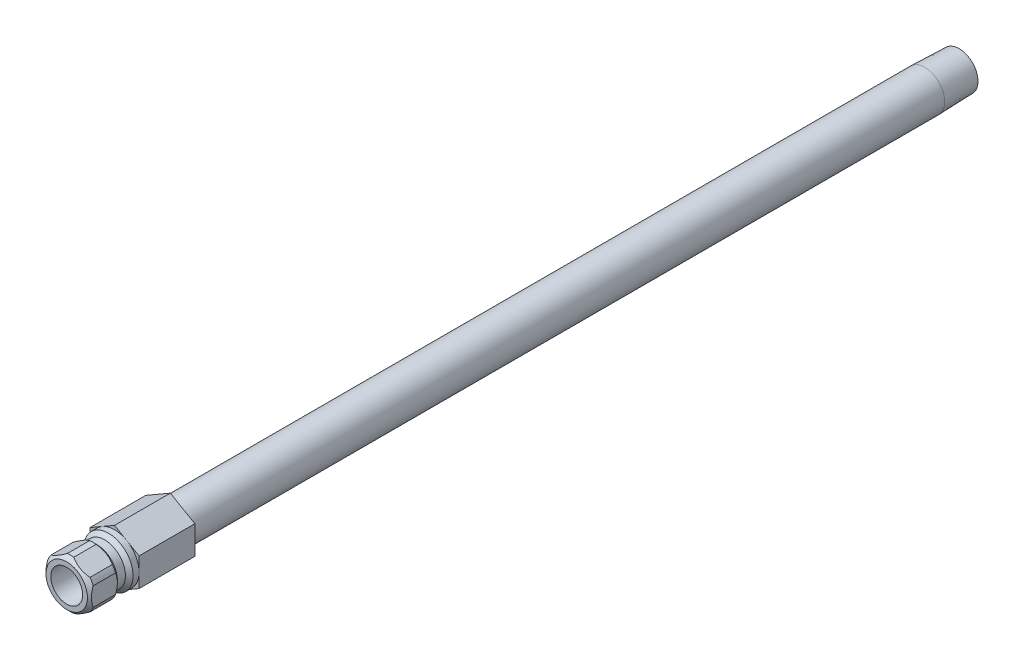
ISO-10303-21;
HEADER;
FILE_DESCRIPTION(('STEP AP214'),'2;1');
FILE_NAME('part.step','',(''),(''),'','','');
FILE_SCHEMA(('AUTOMOTIVE_DESIGN { 1 0 10303 214 1 1 1 1 }'));
ENDSEC;
DATA;
#1=APPLICATION_CONTEXT('core data for automotive mechanical design processes');
#2=APPLICATION_PROTOCOL_DEFINITION('international standard','automotive_design',2000,#1);
#3=PRODUCT_CONTEXT('',#1,'mechanical');
#4=PRODUCT('Part','Part','',(#3));
#5=PRODUCT_RELATED_PRODUCT_CATEGORY('part','',(#4));
#6=PRODUCT_DEFINITION_FORMATION('','',#4);
#7=PRODUCT_DEFINITION_CONTEXT('part definition',#1,'design');
#8=PRODUCT_DEFINITION('design','',#6,#7);
#9=PRODUCT_DEFINITION_SHAPE('','',#8);
#10=(LENGTH_UNIT() NAMED_UNIT(*) SI_UNIT(.MILLI.,.METRE.));
#11=(NAMED_UNIT(*) PLANE_ANGLE_UNIT() SI_UNIT($,.RADIAN.));
#12=(NAMED_UNIT(*) SI_UNIT($,.STERADIAN.) SOLID_ANGLE_UNIT());
#13=UNCERTAINTY_MEASURE_WITH_UNIT(LENGTH_MEASURE(1.E-05),#10,'distance_accuracy_value','');
#14=(GEOMETRIC_REPRESENTATION_CONTEXT(3) GLOBAL_UNCERTAINTY_ASSIGNED_CONTEXT((#13)) GLOBAL_UNIT_ASSIGNED_CONTEXT((#10,
#11,#12)) REPRESENTATION_CONTEXT('',''));
#15=CARTESIAN_POINT('',(0.,0.,0.));
#16=DIRECTION('',(0.,0.,1.));
#17=DIRECTION('',(1.,0.,0.));
#18=AXIS2_PLACEMENT_3D('',#15,#16,#17);
#19=CARTESIAN_POINT('',(0.,0.,0.));
#20=DIRECTION('',(0.,0.,-1.));
#21=DIRECTION('',(0.,1.,0.));
#22=AXIS2_PLACEMENT_3D('',#19,#20,#21);
#23=CYLINDRICAL_SURFACE('',#22,4.8895);
#24=DIRECTION('',(0.,0.,-1.));
#25=VECTOR('',#24,1.);
#26=CARTESIAN_POINT('',(-4.5212,-1.86170910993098,0.));
#27=LINE('',#26,#25);
#28=CARTESIAN_POINT('',(-4.5212,-1.86170910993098,4.318));
#29=VERTEX_POINT('',#28);
#30=CARTESIAN_POINT('',(-4.5212,-1.86170910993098,8.763));
#31=VERTEX_POINT('',#30);
#32=EDGE_CURVE('E395',#29,#31,#27,.F.);
#33=ORIENTED_EDGE('',*,*,#32,.F.);
#34=CARTESIAN_POINT('',(0.,0.,4.318));
#35=DIRECTION('',(0.,0.,-1.));
#36=DIRECTION('',(0.,1.,0.));
#37=AXIS2_PLACEMENT_3D('',#34,#35,#36);
#38=CIRCLE('',#37,4.8895);
#39=CARTESIAN_POINT('',(-3.87288738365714,-2.98461950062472,4.318));
#40=VERTEX_POINT('',#39);
#41=EDGE_CURVE('E204',#40,#29,#38,.T.);
#42=ORIENTED_EDGE('',*,*,#41,.F.);
#43=DIRECTION('',(0.,0.,-1.));
#44=VECTOR('',#43,1.);
#45=CARTESIAN_POINT('',(-3.87288738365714,-2.98461950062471,0.));
#46=LINE('',#45,#44);
#47=CARTESIAN_POINT('',(-3.87288738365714,-2.98461950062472,8.763));
#48=VERTEX_POINT('',#47);
#49=EDGE_CURVE('E378',#48,#40,#46,.T.);
#50=ORIENTED_EDGE('',*,*,#49,.F.);
#51=CARTESIAN_POINT('',(0.,0.,8.763));
#52=DIRECTION('',(0.,0.,-1.));
#53=DIRECTION('',(0.,1.,0.));
#54=AXIS2_PLACEMENT_3D('',#51,#52,#53);
#55=CIRCLE('',#54,4.8895);
#56=EDGE_CURVE('E392',#48,#31,#55,.T.);
#57=ORIENTED_EDGE('',*,*,#56,.T.);
#58=EDGE_LOOP('',(#33,#42,#50,#57));
#59=FACE_BOUND('',#58,.T.);
#60=ADVANCED_FACE('F36',(#59),#23,.T.);
#61=DIRECTION('',(0.,0.,-1.));
#62=VECTOR('',#61,1.);
#63=CARTESIAN_POINT('',(-0.64831261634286,-4.84632861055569,0.));
#64=LINE('',#63,#62);
#65=CARTESIAN_POINT('',(-0.648312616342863,-4.84632861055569,4.318));
#66=VERTEX_POINT('',#65);
#67=CARTESIAN_POINT('',(-0.64831261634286,-4.84632861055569,8.763));
#68=VERTEX_POINT('',#67);
#69=EDGE_CURVE('E291',#66,#68,#64,.F.);
#70=ORIENTED_EDGE('',*,*,#69,.F.);
#71=CARTESIAN_POINT('',(0.648312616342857,-4.84632861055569,4.318));
#72=VERTEX_POINT('',#71);
#73=EDGE_CURVE('E207',#72,#66,#38,.T.);
#74=ORIENTED_EDGE('',*,*,#73,.F.);
#75=DIRECTION('',(0.,0.,-1.));
#76=VECTOR('',#75,1.);
#77=CARTESIAN_POINT('',(0.648312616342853,-4.84632861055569,0.));
#78=LINE('',#77,#76);
#79=CARTESIAN_POINT('',(0.648312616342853,-4.84632861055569,8.763));
#80=VERTEX_POINT('',#79);
#81=EDGE_CURVE('E374',#80,#72,#78,.T.);
#82=ORIENTED_EDGE('',*,*,#81,.F.);
#83=EDGE_CURVE('E376',#80,#68,#55,.T.);
#84=ORIENTED_EDGE('',*,*,#83,.T.);
#85=EDGE_LOOP('',(#70,#74,#82,#84));
#86=FACE_BOUND('',#85,.T.);
#87=ADVANCED_FACE('F327',(#86),#23,.T.);
#88=DIRECTION('',(0.,0.,-1.));
#89=VECTOR('',#88,1.);
#90=CARTESIAN_POINT('',(3.87288738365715,-2.98461950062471,0.));
#91=LINE('',#90,#89);
#92=CARTESIAN_POINT('',(3.87288738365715,-2.98461950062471,4.318));
#93=VERTEX_POINT('',#92);
#94=CARTESIAN_POINT('',(3.87288738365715,-2.98461950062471,8.763));
#95=VERTEX_POINT('',#94);
#96=EDGE_CURVE('E380',#93,#95,#91,.F.);
#97=ORIENTED_EDGE('',*,*,#96,.F.);
#98=CARTESIAN_POINT('',(4.5212,-1.86170910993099,4.318));
#99=VERTEX_POINT('',#98);
#100=EDGE_CURVE('E363',#99,#93,#38,.T.);
#101=ORIENTED_EDGE('',*,*,#100,.F.);
#102=DIRECTION('',(0.,0.,-1.));
#103=VECTOR('',#102,1.);
#104=CARTESIAN_POINT('',(4.5212,-1.86170910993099,0.));
#105=LINE('',#104,#103);
#106=CARTESIAN_POINT('',(4.5212,-1.86170910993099,8.763));
#107=VERTEX_POINT('',#106);
#108=EDGE_CURVE('E385',#107,#99,#105,.T.);
#109=ORIENTED_EDGE('',*,*,#108,.F.);
#110=EDGE_CURVE('E389',#107,#95,#55,.T.);
#111=ORIENTED_EDGE('',*,*,#110,.T.);
#112=EDGE_LOOP('',(#97,#101,#109,#111));
#113=FACE_BOUND('',#112,.T.);
#114=ADVANCED_FACE('F332',(#113),#23,.T.);
#115=DIRECTION('',(0.,0.,-1.));
#116=VECTOR('',#115,1.);
#117=CARTESIAN_POINT('',(4.5212,1.86170910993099,0.));
#118=LINE('',#117,#116);
#119=CARTESIAN_POINT('',(4.5212,1.86170910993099,4.318));
#120=VERTEX_POINT('',#119);
#121=CARTESIAN_POINT('',(4.5212,1.86170910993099,8.763));
#122=VERTEX_POINT('',#121);
#123=EDGE_CURVE('E362',#120,#122,#118,.F.);
#124=ORIENTED_EDGE('',*,*,#123,.F.);
#125=CARTESIAN_POINT('',(3.87288738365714,2.98461950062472,4.318));
#126=VERTEX_POINT('',#125);
#127=EDGE_CURVE('E209',#126,#120,#38,.T.);
#128=ORIENTED_EDGE('',*,*,#127,.F.);
#129=DIRECTION('',(0.,0.,-1.));
#130=VECTOR('',#129,1.);
#131=CARTESIAN_POINT('',(3.87288738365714,2.98461950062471,0.));
#132=LINE('',#131,#130);
#133=CARTESIAN_POINT('',(3.87288738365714,2.98461950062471,8.763));
#134=VERTEX_POINT('',#133);
#135=EDGE_CURVE('E248',#134,#126,#132,.T.);
#136=ORIENTED_EDGE('',*,*,#135,.F.);
#137=EDGE_CURVE('E216',#134,#122,#55,.T.);
#138=ORIENTED_EDGE('',*,*,#137,.T.);
#139=EDGE_LOOP('',(#124,#128,#136,#138));
#140=FACE_BOUND('',#139,.T.);
#141=ADVANCED_FACE('F342',(#140),#23,.T.);
#142=DIRECTION('',(0.,0.,-1.));
#143=VECTOR('',#142,1.);
#144=CARTESIAN_POINT('',(0.648312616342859,4.84632861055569,0.));
#145=LINE('',#144,#143);
#146=CARTESIAN_POINT('',(0.648312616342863,4.84632861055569,4.318));
#147=VERTEX_POINT('',#146);
#148=CARTESIAN_POINT('',(0.648312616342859,4.84632861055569,8.763));
#149=VERTEX_POINT('',#148);
#150=EDGE_CURVE('E351',#147,#149,#145,.F.);
#151=ORIENTED_EDGE('',*,*,#150,.F.);
#152=CARTESIAN_POINT('',(-0.648312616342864,4.84632861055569,4.318));
#153=VERTEX_POINT('',#152);
#154=EDGE_CURVE('E205',#153,#147,#38,.T.);
#155=ORIENTED_EDGE('',*,*,#154,.F.);
#156=DIRECTION('',(0.,0.,-1.));
#157=VECTOR('',#156,1.);
#158=CARTESIAN_POINT('',(-0.648312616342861,4.84632861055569,0.));
#159=LINE('',#158,#157);
#160=CARTESIAN_POINT('',(-0.648312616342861,4.84632861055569,8.763));
#161=VERTEX_POINT('',#160);
#162=EDGE_CURVE('E56',#161,#153,#159,.T.);
#163=ORIENTED_EDGE('',*,*,#162,.F.);
#164=EDGE_CURVE('E213',#161,#149,#55,.T.);
#165=ORIENTED_EDGE('',*,*,#164,.T.);
#166=EDGE_LOOP('',(#151,#155,#163,#165));
#167=FACE_BOUND('',#166,.T.);
#168=ADVANCED_FACE('F336',(#167),#23,.T.);
#169=CARTESIAN_POINT('',(0.,0.,0.));
#170=DIRECTION('',(0.,0.,-1.));
#171=DIRECTION('',(0.,1.,0.));
#172=AXIS2_PLACEMENT_3D('',#169,#170,#171);
#173=CYLINDRICAL_SURFACE('',#172,3.175);
#174=CARTESIAN_POINT('',(0.,0.,0.));
#175=DIRECTION('',(0.,0.,1.));
#176=DIRECTION('',(1.,0.,0.));
#177=AXIS2_PLACEMENT_3D('',#174,#175,#176);
#178=CIRCLE('',#177,3.175);
#179=CARTESIAN_POINT('',(3.175,0.,0.));
#180=VERTEX_POINT('',#179);
#181=EDGE_CURVE('E190',#180,#180,#178,.T.);
#182=ORIENTED_EDGE('',*,*,#181,.F.);
#183=EDGE_LOOP('',(#182));
#184=FACE_BOUND('',#183,.T.);
#185=CARTESIAN_POINT('',(0.,0.,9.525));
#186=DIRECTION('',(0.,0.,-1.));
#187=DIRECTION('',(0.,1.,0.));
#188=AXIS2_PLACEMENT_3D('',#185,#186,#187);
#189=CIRCLE('',#188,3.175);
#190=CARTESIAN_POINT('',(0.,3.175,9.525));
#191=VERTEX_POINT('',#190);
#192=EDGE_CURVE('E220',#191,#191,#189,.T.);
#193=ORIENTED_EDGE('',*,*,#192,.F.);
#194=EDGE_LOOP('',(#193));
#195=FACE_BOUND('',#194,.T.);
#196=ADVANCED_FACE('F38',(#184,#195),#173,.F.);
#197=CARTESIAN_POINT('',(0.,3.175,9.525));
#198=DIRECTION('',(0.,0.,1.));
#199=DIRECTION('',(0.,-1.,0.));
#200=AXIS2_PLACEMENT_3D('',#197,#198,#199);
#201=PLANE('',#200);
#202=ORIENTED_EDGE('',*,*,#192,.T.);
#203=EDGE_LOOP('',(#202));
#204=FACE_BOUND('',#203,.T.);
#205=CARTESIAN_POINT('',(0.,0.,9.525));
#206=DIRECTION('',(0.,0.,-1.));
#207=DIRECTION('',(0.,1.,0.));
#208=AXIS2_PLACEMENT_3D('',#205,#206,#207);
#209=CIRCLE('',#208,4.1275);
#210=CARTESIAN_POINT('',(0.,4.1275,9.525));
#211=VERTEX_POINT('',#210);
#212=EDGE_CURVE('E217',#211,#211,#209,.T.);
#213=ORIENTED_EDGE('',*,*,#212,.F.);
#214=EDGE_LOOP('',(#213));
#215=FACE_BOUND('',#214,.T.);
#216=ADVANCED_FACE('F254',(#204,#215),#201,.T.);
#217=CARTESIAN_POINT('',(0.,0.,8.763));
#218=DIRECTION('',(0.,0.,-1.));
#219=DIRECTION('',(0.,1.,0.));
#220=AXIS2_PLACEMENT_3D('',#217,#218,#219);
#221=CONICAL_SURFACE('',#220,4.8895,0.785398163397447);
#222=CARTESIAN_POINT('',(-4.5212,-5.15925306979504,6.7925334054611));
#223=CARTESIAN_POINT('',(-4.5212,-5.03341781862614,6.88715018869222));
#224=CARTESIAN_POINT('',(-4.5212,-4.90687282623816,6.98083851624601));
#225=CARTESIAN_POINT('',(-4.5212,-4.65208542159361,7.16594426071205));
#226=CARTESIAN_POINT('',(-4.5212,-4.52384258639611,7.25736109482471));
#227=CARTESIAN_POINT('',(-4.5212,-4.26444371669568,7.43815939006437));
#228=CARTESIAN_POINT('',(-4.5212,-4.13327280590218,7.52751958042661));
#229=CARTESIAN_POINT('',(-4.5212,-3.86869655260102,7.70285780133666));
#230=CARTESIAN_POINT('',(-4.5212,-3.735291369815,7.78883607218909));
#231=CARTESIAN_POINT('',(-4.5212,-3.45835736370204,7.9613578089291));
#232=CARTESIAN_POINT('',(-4.5212,-3.31467977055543,8.04766368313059));
#233=CARTESIAN_POINT('',(-4.5212,-3.02397608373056,8.21453070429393));
#234=CARTESIAN_POINT('',(-4.5212,-2.87694947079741,8.29509095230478));
#235=CARTESIAN_POINT('',(-4.5212,-2.57957206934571,8.4487242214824));
#236=CARTESIAN_POINT('',(-4.5212,-2.42923274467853,8.52181925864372));
#237=CARTESIAN_POINT('',(-4.5212,-2.12448469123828,8.6588861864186));
#238=CARTESIAN_POINT('',(-4.5212,-1.97007782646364,8.72286217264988));
#239=CARTESIAN_POINT('',(-4.5212,-1.66898205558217,8.83495217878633));
#240=CARTESIAN_POINT('',(-4.5212,-1.52260919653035,8.88390631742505));
#241=CARTESIAN_POINT('',(-4.5212,-1.22638031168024,8.97006511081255));
#242=CARTESIAN_POINT('',(-4.5212,-1.07652404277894,9.00726894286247));
#243=CARTESIAN_POINT('',(-4.5212,-0.776693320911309,9.06737869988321));
#244=CARTESIAN_POINT('',(-4.5212,-0.626768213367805,9.09052677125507));
#245=CARTESIAN_POINT('',(-4.5212,-0.325366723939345,9.12208307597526));
#246=CARTESIAN_POINT('',(-4.5212,-0.173890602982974,9.13049374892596));
#247=CARTESIAN_POINT('',(-4.5212,0.123852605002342,9.13196931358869));
#248=CARTESIAN_POINT('',(-4.5212,0.270117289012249,9.12555869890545));
#249=CARTESIAN_POINT('',(-4.5212,0.561370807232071,9.09889229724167));
#250=CARTESIAN_POINT('',(-4.5212,0.706359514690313,9.0786351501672));
#251=CARTESIAN_POINT('',(-4.5212,0.99646229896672,9.02502836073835));
#252=CARTESIAN_POINT('',(-4.5212,1.14153485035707,8.99145752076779));
#253=CARTESIAN_POINT('',(-4.5212,1.42852462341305,8.91299975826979));
#254=CARTESIAN_POINT('',(-4.5212,1.5704421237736,8.86811383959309));
#255=CARTESIAN_POINT('',(-4.5212,1.86505501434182,8.7638587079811));
#256=CARTESIAN_POINT('',(-4.5212,2.01739126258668,8.70348456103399));
#257=CARTESIAN_POINT('',(-4.5212,2.318097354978,8.5734817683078));
#258=CARTESIAN_POINT('',(-4.5212,2.46646529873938,8.50384878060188));
#259=CARTESIAN_POINT('',(-4.5212,2.75996557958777,8.35698646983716));
#260=CARTESIAN_POINT('',(-4.5212,2.90508583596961,8.27973319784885));
#261=CARTESIAN_POINT('',(-4.5212,3.1919833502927,8.11933949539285));
#262=CARTESIAN_POINT('',(-4.5212,3.33376113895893,8.03620000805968));
#263=CARTESIAN_POINT('',(-4.5212,3.60742153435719,7.86945863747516));
#264=CARTESIAN_POINT('',(-4.5212,3.73944496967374,7.78608666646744));
#265=CARTESIAN_POINT('',(-4.5212,4.00122581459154,7.61584726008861));
#266=CARTESIAN_POINT('',(-4.5212,4.13098305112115,7.52897955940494));
#267=CARTESIAN_POINT('',(-4.5212,4.38747396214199,7.35309375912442));
#268=CARTESIAN_POINT('',(-4.5212,4.51422365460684,7.26409893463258));
#269=CARTESIAN_POINT('',(-4.5212,4.76599253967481,7.08376363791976));
#270=CARTESIAN_POINT('',(-4.5212,4.8910121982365,6.99242381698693));
#271=CARTESIAN_POINT('',(-4.5212,5.01530771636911,6.90012553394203));
#272=B_SPLINE_CURVE_WITH_KNOTS('',3,(#222,#223,#224,#225,#226,#227,#228,#229,#230,#231,#232,
#233,#234,#235,#236,#237,#238,#239,#240,#241,#242,#243,#244,#245,#246,#247,#248,#249,#250,#251,
#252,#253,#254,#255,#256,#257,#258,#259,#260,#261,#262,#263,#264,#265,#266,#267,#268,#269,#270,
#271),.UNSPECIFIED.,.F.,.F.,(4,2,2,2,2,2,2,2,2,2,2,2,2,2,2,2,2,2,2,2,2,2,2,2,4),(0.,
0.472324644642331,0.944769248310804,1.42087610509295,1.89694907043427,2.39966187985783,
2.90245317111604,3.40371602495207,3.90475303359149,4.36737130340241,4.83002195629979,
5.28445770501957,5.73881822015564,6.1773471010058,6.615919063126,7.06210522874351,
7.50825182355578,7.9994594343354,8.49089821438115,8.98393391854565,9.47689080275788,
9.94525924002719,10.4136632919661,10.8782525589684,11.3427141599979),.UNSPECIFIED.);
#273=CARTESIAN_POINT('',(-4.5212,1.86170910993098,8.763));
#274=VERTEX_POINT('',#273);
#275=EDGE_CURVE('E396',#31,#274,#272,.T.);
#276=ORIENTED_EDGE('',*,*,#275,.F.);
#277=ORIENTED_EDGE('',*,*,#56,.F.);
#278=CARTESIAN_POINT('',(-0.647857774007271,-4.84659121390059,8.7628));
#279=CARTESIAN_POINT('',(-0.775261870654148,-4.77303442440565,8.81886288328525));
#280=CARTESIAN_POINT('',(-0.904457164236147,-4.69844348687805,8.86997372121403));
#281=CARTESIAN_POINT('',(-1.16629518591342,-4.5472712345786,8.96025681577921));
#282=CARTESIAN_POINT('',(-1.29894624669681,-4.47068510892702,8.99939661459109));
#283=CARTESIAN_POINT('',(-1.56203676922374,-4.31878972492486,9.06222407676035));
#284=CARTESIAN_POINT('',(-1.69238331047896,-4.24353411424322,9.08641836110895));
#285=CARTESIAN_POINT('',(-1.95434729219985,-4.09228913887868,9.11997771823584));
#286=CARTESIAN_POINT('',(-2.0859628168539,-4.01630088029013,9.12936242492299));
#287=CARTESIAN_POINT('',(-2.35623055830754,-3.86026172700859,9.1327807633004));
#288=CARTESIAN_POINT('',(-2.49489129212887,-3.78020591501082,9.12598709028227));
#289=CARTESIAN_POINT('',(-2.7710334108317,-3.62077518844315,9.09581500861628));
#290=CARTESIAN_POINT('',(-2.90851272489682,-3.54140146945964,9.07241184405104));
#291=CARTESIAN_POINT('',(-3.18622016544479,-3.38106700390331,9.00944870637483));
#292=CARTESIAN_POINT('',(-3.32634361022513,-3.3001666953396,8.96928925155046));
#293=CARTESIAN_POINT('',(-3.60275664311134,-3.14057955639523,8.87549705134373));
#294=CARTESIAN_POINT('',(-3.73905611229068,-3.06188702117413,8.8219034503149));
#295=CARTESIAN_POINT('',(-3.87334222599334,-2.98435689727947,8.76279999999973));
#296=B_SPLINE_CURVE_WITH_KNOTS('',3,(#278,#279,#280,#281,#282,#283,#284,#285,#286,#287,#288,
#289,#290,#291,#292,#293,#294,#295),.UNSPECIFIED.,.F.,.F.,(4,2,2,2,2,2,2,2,4),(0.,
0.472469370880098,0.946208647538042,1.40285320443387,1.85889185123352,2.33874707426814,
2.81931901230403,3.31879975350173,3.81684169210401),.UNSPECIFIED.);
#297=EDGE_CURVE('E284',#68,#48,#296,.T.);
#298=ORIENTED_EDGE('',*,*,#297,.F.);
#299=ORIENTED_EDGE('',*,*,#83,.F.);
#300=CARTESIAN_POINT('',(3.87334222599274,-2.98435689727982,8.7628));
#301=CARTESIAN_POINT('',(3.74593812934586,-3.05791368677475,8.81886288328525));
#302=CARTESIAN_POINT('',(3.61674283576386,-3.13250462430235,8.86997372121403));
#303=CARTESIAN_POINT('',(3.35490481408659,-3.28367687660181,8.96025681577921));
#304=CARTESIAN_POINT('',(3.2222537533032,-3.36026300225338,8.99939661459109));
#305=CARTESIAN_POINT('',(2.95916323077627,-3.51215838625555,9.06222407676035));
#306=CARTESIAN_POINT('',(2.82881668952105,-3.58741399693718,9.08641836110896));
#307=CARTESIAN_POINT('',(2.56685270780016,-3.73865897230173,9.11997771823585));
#308=CARTESIAN_POINT('',(2.43523718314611,-3.81464723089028,9.129362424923));
#309=CARTESIAN_POINT('',(2.16496944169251,-3.97068638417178,9.1327807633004));
#310=CARTESIAN_POINT('',(2.02630870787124,-4.05074219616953,9.12598709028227));
#311=CARTESIAN_POINT('',(1.75016658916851,-4.21017292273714,9.09581500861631));
#312=CARTESIAN_POINT('',(1.61268727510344,-4.28954664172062,9.07241184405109));
#313=CARTESIAN_POINT('',(1.33497983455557,-4.44988110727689,9.00944870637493));
#314=CARTESIAN_POINT('',(1.19485638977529,-4.53078141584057,8.96928925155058));
#315=CARTESIAN_POINT('',(0.91844335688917,-4.69036855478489,8.87549705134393));
#316=CARTESIAN_POINT('',(0.78214388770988,-4.76906109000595,8.82190345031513));
#317=CARTESIAN_POINT('',(0.647857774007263,-4.84659121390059,8.7628));
#318=B_SPLINE_CURVE_WITH_KNOTS('',3,(#300,#301,#302,#303,#304,#305,#306,#307,#308,#309,#310,
#311,#312,#313,#314,#315,#316,#317),.UNSPECIFIED.,.F.,.F.,(4,2,2,2,2,2,2,2,4),(0.,
0.472469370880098,0.946208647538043,1.40285320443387,1.85889185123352,2.33874707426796,
2.81931901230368,3.31879975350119,3.81684169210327),.UNSPECIFIED.);
#319=EDGE_CURVE('E276',#95,#80,#318,.T.);
#320=ORIENTED_EDGE('',*,*,#319,.F.);
#321=ORIENTED_EDGE('',*,*,#110,.F.);
#322=CARTESIAN_POINT('',(4.5212,-5.15925306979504,6.7925334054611));
#323=CARTESIAN_POINT('',(4.5212,-5.03341781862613,6.88715018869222));
#324=CARTESIAN_POINT('',(4.5212,-4.90687282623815,6.98083851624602));
#325=CARTESIAN_POINT('',(4.5212,-4.65208542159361,7.16594426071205));
#326=CARTESIAN_POINT('',(4.5212,-4.52384258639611,7.25736109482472));
#327=CARTESIAN_POINT('',(4.5212,-4.26444371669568,7.43815939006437));
#328=CARTESIAN_POINT('',(4.5212,-4.13327280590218,7.52751958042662));
#329=CARTESIAN_POINT('',(4.5212,-3.86869655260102,7.70285780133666));
#330=CARTESIAN_POINT('',(4.5212,-3.73529136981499,7.7888360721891));
#331=CARTESIAN_POINT('',(4.5212,-3.45835736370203,7.9613578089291));
#332=CARTESIAN_POINT('',(4.5212,-3.31467977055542,8.04766368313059));
#333=CARTESIAN_POINT('',(4.5212,-3.02397608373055,8.21453070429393));
#334=CARTESIAN_POINT('',(4.5212,-2.87694947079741,8.29509095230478));
#335=CARTESIAN_POINT('',(4.5212,-2.57957206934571,8.44872422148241));
#336=CARTESIAN_POINT('',(4.5212,-2.42923274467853,8.52181925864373));
#337=CARTESIAN_POINT('',(4.5212,-2.12448469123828,8.6588861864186));
#338=CARTESIAN_POINT('',(4.5212,-1.97007782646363,8.72286217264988));
#339=CARTESIAN_POINT('',(4.5212,-1.66898205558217,8.83495217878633));
#340=CARTESIAN_POINT('',(4.5212,-1.52260919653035,8.88390631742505));
#341=CARTESIAN_POINT('',(4.5212,-1.22638031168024,8.97006511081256));
#342=CARTESIAN_POINT('',(4.5212,-1.07652404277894,9.00726894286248));
#343=CARTESIAN_POINT('',(4.5212,-0.776693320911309,9.06737869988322));
#344=CARTESIAN_POINT('',(4.5212,-0.626768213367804,9.09052677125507));
#345=CARTESIAN_POINT('',(4.5212,-0.325366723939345,9.12208307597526));
#346=CARTESIAN_POINT('',(4.5212,-0.173890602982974,9.13049374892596));
#347=CARTESIAN_POINT('',(4.5212,0.123852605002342,9.13196931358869));
#348=CARTESIAN_POINT('',(4.5212,0.270117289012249,9.12555869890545));
#349=CARTESIAN_POINT('',(4.5212,0.56137080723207,9.09889229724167));
#350=CARTESIAN_POINT('',(4.5212,0.706359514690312,9.0786351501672));
#351=CARTESIAN_POINT('',(4.5212,0.996462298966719,9.02502836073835));
#352=CARTESIAN_POINT('',(4.5212,1.14153485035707,8.99145752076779));
#353=CARTESIAN_POINT('',(4.5212,1.42852462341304,8.91299975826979));
#354=CARTESIAN_POINT('',(4.5212,1.5704421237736,8.86811383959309));
#355=CARTESIAN_POINT('',(4.5212,1.86505501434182,8.76385870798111));
#356=CARTESIAN_POINT('',(4.5212,2.01739126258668,8.703484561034));
#357=CARTESIAN_POINT('',(4.5212,2.318097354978,8.57348176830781));
#358=CARTESIAN_POINT('',(4.5212,2.46646529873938,8.50384878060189));
#359=CARTESIAN_POINT('',(4.5212,2.75996557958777,8.35698646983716));
#360=CARTESIAN_POINT('',(4.5212,2.9050858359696,8.27973319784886));
#361=CARTESIAN_POINT('',(4.5212,3.1919833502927,8.11933949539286));
#362=CARTESIAN_POINT('',(4.5212,3.33376113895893,8.03620000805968));
#363=CARTESIAN_POINT('',(4.5212,3.60742153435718,7.86945863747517));
#364=CARTESIAN_POINT('',(4.5212,3.73944496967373,7.78608666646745));
#365=CARTESIAN_POINT('',(4.5212,4.00122581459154,7.61584726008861));
#366=CARTESIAN_POINT('',(4.5212,4.13098305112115,7.52897955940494));
#367=CARTESIAN_POINT('',(4.5212,4.38747396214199,7.35309375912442));
#368=CARTESIAN_POINT('',(4.5212,4.51422365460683,7.26409893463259));
#369=CARTESIAN_POINT('',(4.5212,4.7659925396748,7.08376363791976));
#370=CARTESIAN_POINT('',(4.5212,4.89101219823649,6.99242381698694));
#371=CARTESIAN_POINT('',(4.5212,5.01530771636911,6.90012553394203));
#372=B_SPLINE_CURVE_WITH_KNOTS('',3,(#322,#323,#324,#325,#326,#327,#328,#329,#330,#331,#332,
#333,#334,#335,#336,#337,#338,#339,#340,#341,#342,#343,#344,#345,#346,#347,#348,#349,#350,#351,
#352,#353,#354,#355,#356,#357,#358,#359,#360,#361,#362,#363,#364,#365,#366,#367,#368,#369,#370,
#371),.UNSPECIFIED.,.F.,.F.,(4,2,2,2,2,2,2,2,2,2,2,2,2,2,2,2,2,2,2,2,2,2,2,2,4),(0.,
0.472324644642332,0.944769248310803,1.42087610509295,1.89694907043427,2.39966187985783,
2.90245317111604,3.40371602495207,3.90475303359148,4.3673713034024,4.83002195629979,
5.28445770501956,5.73881822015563,6.17734710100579,6.61591906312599,7.0621052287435,
7.50825182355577,7.9994594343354,8.49089821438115,8.98393391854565,9.47689080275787,
9.94525924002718,10.4136632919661,10.8782525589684,11.3427141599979),.UNSPECIFIED.);
#373=EDGE_CURVE('E269',#122,#107,#372,.F.);
#374=ORIENTED_EDGE('',*,*,#373,.F.);
#375=ORIENTED_EDGE('',*,*,#137,.F.);
#376=CARTESIAN_POINT('',(0.64785777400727,4.84659121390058,8.7628));
#377=CARTESIAN_POINT('',(0.775261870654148,4.77303442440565,8.81886288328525));
#378=CARTESIAN_POINT('',(0.904457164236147,4.69844348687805,8.86997372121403));
#379=CARTESIAN_POINT('',(1.16629518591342,4.5472712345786,8.96025681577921));
#380=CARTESIAN_POINT('',(1.29894624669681,4.47068510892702,8.99939661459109));
#381=CARTESIAN_POINT('',(1.56203676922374,4.31878972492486,9.06222407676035));
#382=CARTESIAN_POINT('',(1.69238331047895,4.24353411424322,9.08641836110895));
#383=CARTESIAN_POINT('',(1.95434729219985,4.09228913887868,9.11997771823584));
#384=CARTESIAN_POINT('',(2.0859628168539,4.01630088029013,9.12936242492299));
#385=CARTESIAN_POINT('',(2.35623055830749,3.86026172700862,9.1327807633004));
#386=CARTESIAN_POINT('',(2.49489129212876,3.78020591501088,9.12598709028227));
#387=CARTESIAN_POINT('',(2.77103341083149,3.62077518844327,9.09581500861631));
#388=CARTESIAN_POINT('',(2.90851272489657,3.54140146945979,9.07241184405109));
#389=CARTESIAN_POINT('',(3.18622016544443,3.38106700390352,9.00944870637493));
#390=CARTESIAN_POINT('',(3.32634361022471,3.30016669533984,8.96928925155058));
#391=CARTESIAN_POINT('',(3.60275664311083,3.14057955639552,8.87549705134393));
#392=CARTESIAN_POINT('',(3.73905611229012,3.06188702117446,8.82190345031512));
#393=CARTESIAN_POINT('',(3.87334222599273,2.98435689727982,8.7628));
#394=B_SPLINE_CURVE_WITH_KNOTS('',3,(#376,#377,#378,#379,#380,#381,#382,#383,#384,#385,#386,
#387,#388,#389,#390,#391,#392,#393),.UNSPECIFIED.,.F.,.F.,(4,2,2,2,2,2,2,2,4),(0.,
0.472469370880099,0.946208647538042,1.40285320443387,1.85889185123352,2.33874707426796,
2.81931901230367,3.31879975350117,3.81684169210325),.UNSPECIFIED.);
#395=EDGE_CURVE('E262',#149,#134,#394,.T.);
#396=ORIENTED_EDGE('',*,*,#395,.F.);
#397=ORIENTED_EDGE('',*,*,#164,.F.);
#398=CARTESIAN_POINT('',(-3.87334222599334,2.98435689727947,8.76279999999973));
#399=CARTESIAN_POINT('',(-3.74593812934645,3.05791368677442,8.81886288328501));
#400=CARTESIAN_POINT('',(-3.61674283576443,3.13250462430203,8.86997372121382));
#401=CARTESIAN_POINT('',(-3.35490481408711,3.28367687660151,8.96025681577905));
#402=CARTESIAN_POINT('',(-3.2222537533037,3.3602630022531,8.99939661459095));
#403=CARTESIAN_POINT('',(-2.95916323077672,3.51215838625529,9.06222407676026));
#404=CARTESIAN_POINT('',(-2.82881668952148,3.58741399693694,9.08641836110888));
#405=CARTESIAN_POINT('',(-2.56685270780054,3.73865897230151,9.11997771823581));
#406=CARTESIAN_POINT('',(-2.43523718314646,3.81464723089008,9.12936242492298));
#407=CARTESIAN_POINT('',(-2.16496944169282,3.97068638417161,9.13278076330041));
#408=CARTESIAN_POINT('',(-2.02630870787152,4.05074219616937,9.12598709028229));
#409=CARTESIAN_POINT('',(-1.75016658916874,4.21017292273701,9.09581500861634));
#410=CARTESIAN_POINT('',(-1.61268727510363,4.2895466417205,9.07241184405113));
#411=CARTESIAN_POINT('',(-1.33497983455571,4.44988110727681,9.00944870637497));
#412=CARTESIAN_POINT('',(-1.1948563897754,4.5307814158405,8.96928925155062));
#413=CARTESIAN_POINT('',(-0.918443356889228,4.69036855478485,8.87549705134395));
#414=CARTESIAN_POINT('',(-0.782143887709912,4.76906109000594,8.82190345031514));
#415=CARTESIAN_POINT('',(-0.647857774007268,4.84659121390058,8.7628));
#416=B_SPLINE_CURVE_WITH_KNOTS('',3,(#398,#399,#400,#401,#402,#403,#404,#405,#406,#407,#408,
#409,#410,#411,#412,#413,#414,#415),.UNSPECIFIED.,.F.,.F.,(4,2,2,2,2,2,2,2,4),(0.,
0.472469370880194,0.946208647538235,1.40285320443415,1.85889185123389,2.33874707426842,
2.81931901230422,3.31879975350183,3.81684169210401),.UNSPECIFIED.);
#417=CARTESIAN_POINT('',(-3.87288738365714,2.98461950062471,8.763));
#418=VERTEX_POINT('',#417);
#419=EDGE_CURVE('E199',#418,#161,#416,.T.);
#420=ORIENTED_EDGE('',*,*,#419,.F.);
#421=EDGE_CURVE('E198',#274,#418,#55,.T.);
#422=ORIENTED_EDGE('',*,*,#421,.F.);
#423=EDGE_LOOP('',(#276,#277,#298,#299,#320,#321,#374,#375,#396,#397,#420,#422));
#424=FACE_BOUND('',#423,.T.);
#425=ORIENTED_EDGE('',*,*,#212,.T.);
#426=EDGE_LOOP('',(#425));
#427=FACE_BOUND('',#426,.T.);
#428=ADVANCED_FACE('F251',(#424,#427),#221,.T.);
#429=DIRECTION('',(0.,0.,-1.));
#430=VECTOR('',#429,1.);
#431=CARTESIAN_POINT('',(-4.5212,1.86170910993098,0.));
#432=LINE('',#431,#430);
#433=CARTESIAN_POINT('',(-4.5212,1.86170910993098,4.318));
#434=VERTEX_POINT('',#433);
#435=EDGE_CURVE('E63',#274,#434,#432,.T.);
#436=ORIENTED_EDGE('',*,*,#435,.F.);
#437=ORIENTED_EDGE('',*,*,#421,.T.);
#438=DIRECTION('',(0.,0.,-1.));
#439=VECTOR('',#438,1.);
#440=CARTESIAN_POINT('',(-3.87288738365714,2.98461950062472,0.));
#441=LINE('',#440,#439);
#442=CARTESIAN_POINT('',(-3.87288738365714,2.98461950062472,4.318));
#443=VERTEX_POINT('',#442);
#444=EDGE_CURVE('E183',#443,#418,#441,.F.);
#445=ORIENTED_EDGE('',*,*,#444,.F.);
#446=EDGE_CURVE('E196',#434,#443,#38,.T.);
#447=ORIENTED_EDGE('',*,*,#446,.F.);
#448=EDGE_LOOP('',(#436,#437,#445,#447));
#449=FACE_BOUND('',#448,.T.);
#450=ADVANCED_FACE('F195',(#449),#23,.T.);
#451=CARTESIAN_POINT('',(0.,0.,3.556));
#452=DIRECTION('',(0.,0.,1.));
#453=DIRECTION('',(0.,-1.,0.));
#454=AXIS2_PLACEMENT_3D('',#451,#452,#453);
#455=CONICAL_SURFACE('',#454,4.1275,0.785398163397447);
#456=CARTESIAN_POINT('',(-4.5212,-5.15925306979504,6.2884665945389));
#457=CARTESIAN_POINT('',(-4.5212,-5.03341781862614,6.19384981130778));
#458=CARTESIAN_POINT('',(-4.5212,-4.90687282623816,6.10016148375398));
#459=CARTESIAN_POINT('',(-4.5212,-4.65208542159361,5.91505573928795));
#460=CARTESIAN_POINT('',(-4.5212,-4.52384258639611,5.82363890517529));
#461=CARTESIAN_POINT('',(-4.5212,-4.26444371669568,5.64284060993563));
#462=CARTESIAN_POINT('',(-4.5212,-4.13327280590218,5.55348041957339));
#463=CARTESIAN_POINT('',(-4.5212,-3.86869655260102,5.37814219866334));
#464=CARTESIAN_POINT('',(-4.5212,-3.735291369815,5.29216392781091));
#465=CARTESIAN_POINT('',(-4.5212,-3.45835736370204,5.1196421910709));
#466=CARTESIAN_POINT('',(-4.5212,-3.31467977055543,5.03333631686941));
#467=CARTESIAN_POINT('',(-4.5212,-3.02397608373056,4.86646929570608));
#468=CARTESIAN_POINT('',(-4.5212,-2.87694947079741,4.78590904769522));
#469=CARTESIAN_POINT('',(-4.5212,-2.57957206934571,4.6322757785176));
#470=CARTESIAN_POINT('',(-4.5212,-2.42923274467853,4.55918074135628));
#471=CARTESIAN_POINT('',(-4.5212,-2.12448469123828,4.4221138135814));
#472=CARTESIAN_POINT('',(-4.5212,-1.97007782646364,4.35813782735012));
#473=CARTESIAN_POINT('',(-4.5212,-1.66898205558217,4.24604782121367));
#474=CARTESIAN_POINT('',(-4.5212,-1.52260919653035,4.19709368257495));
#475=CARTESIAN_POINT('',(-4.5212,-1.22638031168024,4.11093488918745));
#476=CARTESIAN_POINT('',(-4.5212,-1.07652404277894,4.07373105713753));
#477=CARTESIAN_POINT('',(-4.5212,-0.776693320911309,4.01362130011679));
#478=CARTESIAN_POINT('',(-4.5212,-0.626768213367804,3.99047322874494));
#479=CARTESIAN_POINT('',(-4.5212,-0.325366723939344,3.95891692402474));
#480=CARTESIAN_POINT('',(-4.5212,-0.173890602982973,3.95050625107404));
#481=CARTESIAN_POINT('',(-4.5212,0.123852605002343,3.94903068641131));
#482=CARTESIAN_POINT('',(-4.5212,0.27011728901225,3.95544130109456));
#483=CARTESIAN_POINT('',(-4.5212,0.561370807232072,3.98210770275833));
#484=CARTESIAN_POINT('',(-4.5212,0.706359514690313,4.0023648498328));
#485=CARTESIAN_POINT('',(-4.5212,0.996462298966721,4.05597163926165));
#486=CARTESIAN_POINT('',(-4.5212,1.14153485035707,4.08954247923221));
#487=CARTESIAN_POINT('',(-4.5212,1.42852462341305,4.16800024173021));
#488=CARTESIAN_POINT('',(-4.5212,1.5704421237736,4.21288616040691));
#489=CARTESIAN_POINT('',(-4.5212,1.86505501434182,4.3171412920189));
#490=CARTESIAN_POINT('',(-4.5212,2.01739126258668,4.37751543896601));
#491=CARTESIAN_POINT('',(-4.5212,2.318097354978,4.5075182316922));
#492=CARTESIAN_POINT('',(-4.5212,2.46646529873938,4.57715121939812));
#493=CARTESIAN_POINT('',(-4.5212,2.75996557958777,4.72401353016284));
#494=CARTESIAN_POINT('',(-4.5212,2.90508583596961,4.80126680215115));
#495=CARTESIAN_POINT('',(-4.5212,3.1919833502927,4.96166050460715));
#496=CARTESIAN_POINT('',(-4.5212,3.33376113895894,5.04479999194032));
#497=CARTESIAN_POINT('',(-4.5212,3.60742153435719,5.21154136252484));
#498=CARTESIAN_POINT('',(-4.5212,3.73944496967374,5.29491333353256));
#499=CARTESIAN_POINT('',(-4.5212,4.00122581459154,5.4651527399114));
#500=CARTESIAN_POINT('',(-4.5212,4.13098305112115,5.55202044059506));
#501=CARTESIAN_POINT('',(-4.5212,4.38747396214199,5.72790624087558));
#502=CARTESIAN_POINT('',(-4.5212,4.51422365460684,5.81690106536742));
#503=CARTESIAN_POINT('',(-4.5212,4.76599253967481,5.99723636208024));
#504=CARTESIAN_POINT('',(-4.5212,4.8910121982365,6.08857618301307));
#505=CARTESIAN_POINT('',(-4.5212,5.01530771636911,6.18087446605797));
#506=B_SPLINE_CURVE_WITH_KNOTS('',3,(#456,#457,#458,#459,#460,#461,#462,#463,#464,#465,#466,
#467,#468,#469,#470,#471,#472,#473,#474,#475,#476,#477,#478,#479,#480,#481,#482,#483,#484,#485,
#486,#487,#488,#489,#490,#491,#492,#493,#494,#495,#496,#497,#498,#499,#500,#501,#502,#503,#504,
#505),.UNSPECIFIED.,.F.,.F.,(4,2,2,2,2,2,2,2,2,2,2,2,2,2,2,2,2,2,2,2,2,2,2,2,4),(0.,
0.472324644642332,0.944769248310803,1.42087610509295,1.89694907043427,2.39966187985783,
2.90245317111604,3.40371602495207,3.90475303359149,4.36737130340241,4.83002195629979,
5.28445770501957,5.73881822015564,6.1773471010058,6.615919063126,7.06210522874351,
7.50825182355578,7.9994594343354,8.49089821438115,8.98393391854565,9.47689080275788,
9.94525924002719,10.4136632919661,10.8782525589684,11.3427141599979),.UNSPECIFIED.);
#507=EDGE_CURVE('E12',#434,#29,#506,.F.);
#508=ORIENTED_EDGE('',*,*,#507,.F.);
#509=ORIENTED_EDGE('',*,*,#446,.T.);
#510=CARTESIAN_POINT('',(-0.64785777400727,4.84659121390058,4.3182));
#511=CARTESIAN_POINT('',(-0.775261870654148,4.77303442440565,4.26213711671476));
#512=CARTESIAN_POINT('',(-0.904457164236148,4.69844348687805,4.21102627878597));
#513=CARTESIAN_POINT('',(-1.16629518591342,4.5472712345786,4.12074318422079));
#514=CARTESIAN_POINT('',(-1.29894624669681,4.47068510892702,4.08160338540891));
#515=CARTESIAN_POINT('',(-1.56203676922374,4.31878972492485,4.01877592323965));
#516=CARTESIAN_POINT('',(-1.69238331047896,4.24353411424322,3.99458163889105));
#517=CARTESIAN_POINT('',(-1.95434729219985,4.09228913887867,3.96102228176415));
#518=CARTESIAN_POINT('',(-2.0859628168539,4.01630088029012,3.95163757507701));
#519=CARTESIAN_POINT('',(-2.35623055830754,3.86026172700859,3.9482192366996));
#520=CARTESIAN_POINT('',(-2.49489129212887,3.78020591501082,3.95501290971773));
#521=CARTESIAN_POINT('',(-2.7710334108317,3.62077518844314,3.98518499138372));
#522=CARTESIAN_POINT('',(-2.90851272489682,3.54140146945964,4.00858815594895));
#523=CARTESIAN_POINT('',(-3.18622016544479,3.38106700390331,4.07155129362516));
#524=CARTESIAN_POINT('',(-3.32634361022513,3.3001666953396,4.11171074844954));
#525=CARTESIAN_POINT('',(-3.60275664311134,3.14057955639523,4.20550294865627));
#526=CARTESIAN_POINT('',(-3.73905611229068,3.06188702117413,4.2590965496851));
#527=CARTESIAN_POINT('',(-3.87334222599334,2.98435689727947,4.31820000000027));
#528=B_SPLINE_CURVE_WITH_KNOTS('',3,(#510,#511,#512,#513,#514,#515,#516,#517,#518,#519,#520,
#521,#522,#523,#524,#525,#526,#527),.UNSPECIFIED.,.F.,.F.,(4,2,2,2,2,2,2,2,4),(0.,
0.472469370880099,0.946208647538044,1.40285320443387,1.85889185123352,2.33874707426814,
2.81931901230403,3.31879975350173,3.81684169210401),.UNSPECIFIED.);
#529=EDGE_CURVE('E180',#153,#443,#528,.T.);
#530=ORIENTED_EDGE('',*,*,#529,.F.);
#531=ORIENTED_EDGE('',*,*,#154,.T.);
#532=CARTESIAN_POINT('',(3.87334222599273,2.98435689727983,4.3182));
#533=CARTESIAN_POINT('',(3.74593812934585,3.05791368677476,4.26213711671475));
#534=CARTESIAN_POINT('',(3.61674283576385,3.13250462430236,4.21102627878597));
#535=CARTESIAN_POINT('',(3.35490481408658,3.28367687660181,4.12074318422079));
#536=CARTESIAN_POINT('',(3.22225375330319,3.36026300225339,4.08160338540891));
#537=CARTESIAN_POINT('',(2.95916323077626,3.51215838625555,4.01877592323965));
#538=CARTESIAN_POINT('',(2.82881668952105,3.58741399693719,3.99458163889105));
#539=CARTESIAN_POINT('',(2.56685270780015,3.73865897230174,3.96102228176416));
#540=CARTESIAN_POINT('',(2.4352371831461,3.81464723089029,3.95163757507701));
#541=CARTESIAN_POINT('',(2.16496944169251,3.97068638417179,3.94821923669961));
#542=CARTESIAN_POINT('',(2.02630870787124,4.05074219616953,3.95501290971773));
#543=CARTESIAN_POINT('',(1.75016658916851,4.21017292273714,3.98518499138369));
#544=CARTESIAN_POINT('',(1.61268727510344,4.28954664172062,4.00858815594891));
#545=CARTESIAN_POINT('',(1.33497983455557,4.44988110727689,4.07155129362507));
#546=CARTESIAN_POINT('',(1.19485638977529,4.53078141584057,4.11171074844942));
#547=CARTESIAN_POINT('',(0.918443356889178,4.69036855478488,4.20550294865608));
#548=CARTESIAN_POINT('',(0.78214388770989,4.76906109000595,4.25909654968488));
#549=CARTESIAN_POINT('',(0.647857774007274,4.84659121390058,4.3182));
#550=B_SPLINE_CURVE_WITH_KNOTS('',3,(#532,#533,#534,#535,#536,#537,#538,#539,#540,#541,#542,
#543,#544,#545,#546,#547,#548,#549),.UNSPECIFIED.,.F.,.F.,(4,2,2,2,2,2,2,2,4),(0.,
0.472469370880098,0.946208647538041,1.40285320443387,1.85889185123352,2.33874707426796,
2.81931901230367,3.31879975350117,3.81684169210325),.UNSPECIFIED.);
#551=EDGE_CURVE('E189',#126,#147,#550,.T.);
#552=ORIENTED_EDGE('',*,*,#551,.F.);
#553=ORIENTED_EDGE('',*,*,#127,.T.);
#554=CARTESIAN_POINT('',(4.5212,-5.15925306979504,6.2884665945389));
#555=CARTESIAN_POINT('',(4.5212,-5.03341781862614,6.19384981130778));
#556=CARTESIAN_POINT('',(4.5212,-4.90687282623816,6.10016148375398));
#557=CARTESIAN_POINT('',(4.5212,-4.65208542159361,5.91505573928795));
#558=CARTESIAN_POINT('',(4.5212,-4.52384258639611,5.82363890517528));
#559=CARTESIAN_POINT('',(4.5212,-4.26444371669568,5.64284060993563));
#560=CARTESIAN_POINT('',(4.5212,-4.13327280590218,5.55348041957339));
#561=CARTESIAN_POINT('',(4.5212,-3.86869655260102,5.37814219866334));
#562=CARTESIAN_POINT('',(4.5212,-3.735291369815,5.2921639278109));
#563=CARTESIAN_POINT('',(4.5212,-3.45835736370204,5.1196421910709));
#564=CARTESIAN_POINT('',(4.5212,-3.31467977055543,5.03333631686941));
#565=CARTESIAN_POINT('',(4.5212,-3.02397608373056,4.86646929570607));
#566=CARTESIAN_POINT('',(4.5212,-2.87694947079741,4.78590904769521));
#567=CARTESIAN_POINT('',(4.5212,-2.57957206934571,4.63227577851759));
#568=CARTESIAN_POINT('',(4.5212,-2.42923274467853,4.55918074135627));
#569=CARTESIAN_POINT('',(4.5212,-2.12448469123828,4.4221138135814));
#570=CARTESIAN_POINT('',(4.5212,-1.97007782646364,4.35813782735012));
#571=CARTESIAN_POINT('',(4.5212,-1.66898205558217,4.24604782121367));
#572=CARTESIAN_POINT('',(4.5212,-1.52260919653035,4.19709368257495));
#573=CARTESIAN_POINT('',(4.5212,-1.22638031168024,4.11093488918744));
#574=CARTESIAN_POINT('',(4.5212,-1.07652404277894,4.07373105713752));
#575=CARTESIAN_POINT('',(4.5212,-0.776693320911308,4.01362130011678));
#576=CARTESIAN_POINT('',(4.5212,-0.626768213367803,3.99047322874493));
#577=CARTESIAN_POINT('',(4.5212,-0.325366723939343,3.95891692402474));
#578=CARTESIAN_POINT('',(4.5212,-0.173890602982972,3.95050625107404));
#579=CARTESIAN_POINT('',(4.5212,0.123852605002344,3.94903068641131));
#580=CARTESIAN_POINT('',(4.5212,0.270117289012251,3.95544130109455));
#581=CARTESIAN_POINT('',(4.5212,0.561370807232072,3.98210770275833));
#582=CARTESIAN_POINT('',(4.5212,0.706359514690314,4.0023648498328));
#583=CARTESIAN_POINT('',(4.5212,0.996462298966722,4.05597163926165));
#584=CARTESIAN_POINT('',(4.5212,1.14153485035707,4.08954247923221));
#585=CARTESIAN_POINT('',(4.5212,1.42852462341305,4.16800024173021));
#586=CARTESIAN_POINT('',(4.5212,1.5704421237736,4.21288616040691));
#587=CARTESIAN_POINT('',(4.5212,1.86505501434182,4.3171412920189));
#588=CARTESIAN_POINT('',(4.5212,2.01739126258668,4.377515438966));
#589=CARTESIAN_POINT('',(4.5212,2.318097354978,4.5075182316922));
#590=CARTESIAN_POINT('',(4.5212,2.46646529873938,4.57715121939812));
#591=CARTESIAN_POINT('',(4.5212,2.75996557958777,4.72401353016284));
#592=CARTESIAN_POINT('',(4.5212,2.90508583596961,4.80126680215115));
#593=CARTESIAN_POINT('',(4.5212,3.1919833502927,4.96166050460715));
#594=CARTESIAN_POINT('',(4.5212,3.33376113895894,5.04479999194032));
#595=CARTESIAN_POINT('',(4.5212,3.60742153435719,5.21154136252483));
#596=CARTESIAN_POINT('',(4.5212,3.73944496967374,5.29491333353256));
#597=CARTESIAN_POINT('',(4.5212,4.00122581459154,5.46515273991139));
#598=CARTESIAN_POINT('',(4.5212,4.13098305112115,5.55202044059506));
#599=CARTESIAN_POINT('',(4.5212,4.38747396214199,5.72790624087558));
#600=CARTESIAN_POINT('',(4.5212,4.51422365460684,5.81690106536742));
#601=CARTESIAN_POINT('',(4.5212,4.76599253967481,5.99723636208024));
#602=CARTESIAN_POINT('',(4.5212,4.8910121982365,6.08857618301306));
#603=CARTESIAN_POINT('',(4.5212,5.01530771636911,6.18087446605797));
#604=B_SPLINE_CURVE_WITH_KNOTS('',3,(#554,#555,#556,#557,#558,#559,#560,#561,#562,#563,#564,
#565,#566,#567,#568,#569,#570,#571,#572,#573,#574,#575,#576,#577,#578,#579,#580,#581,#582,#583,
#584,#585,#586,#587,#588,#589,#590,#591,#592,#593,#594,#595,#596,#597,#598,#599,#600,#601,#602,
#603),.UNSPECIFIED.,.F.,.F.,(4,2,2,2,2,2,2,2,2,2,2,2,2,2,2,2,2,2,2,2,2,2,2,2,4),(0.,
0.472324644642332,0.944769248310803,1.42087610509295,1.89694907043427,2.39966187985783,
2.90245317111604,3.40371602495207,3.90475303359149,4.36737130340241,4.83002195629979,
5.28445770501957,5.73881822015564,6.1773471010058,6.615919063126,7.06210522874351,
7.50825182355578,7.9994594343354,8.49089821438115,8.98393391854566,9.47689080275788,
9.94525924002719,10.4136632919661,10.8782525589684,11.3427141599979),.UNSPECIFIED.);
#605=EDGE_CURVE('E311',#99,#120,#604,.T.);
#606=ORIENTED_EDGE('',*,*,#605,.F.);
#607=ORIENTED_EDGE('',*,*,#100,.T.);
#608=CARTESIAN_POINT('',(0.647857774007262,-4.84659121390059,4.3182));
#609=CARTESIAN_POINT('',(0.775261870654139,-4.77303442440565,4.26213711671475));
#610=CARTESIAN_POINT('',(0.904457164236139,-4.69844348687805,4.21102627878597));
#611=CARTESIAN_POINT('',(1.16629518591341,-4.5472712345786,4.12074318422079));
#612=CARTESIAN_POINT('',(1.2989462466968,-4.47068510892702,4.08160338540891));
#613=CARTESIAN_POINT('',(1.56203676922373,-4.31878972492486,4.01877592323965));
#614=CARTESIAN_POINT('',(1.69238331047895,-4.24353411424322,3.99458163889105));
#615=CARTESIAN_POINT('',(1.95434729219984,-4.09228913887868,3.96102228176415));
#616=CARTESIAN_POINT('',(2.0859628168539,-4.01630088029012,3.951637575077));
#617=CARTESIAN_POINT('',(2.35623055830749,-3.86026172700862,3.9482192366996));
#618=CARTESIAN_POINT('',(2.49489129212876,-3.78020591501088,3.95501290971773));
#619=CARTESIAN_POINT('',(2.77103341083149,-3.62077518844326,3.98518499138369));
#620=CARTESIAN_POINT('',(2.90851272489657,-3.54140146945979,4.00858815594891));
#621=CARTESIAN_POINT('',(3.18622016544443,-3.38106700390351,4.07155129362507));
#622=CARTESIAN_POINT('',(3.32634361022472,-3.30016669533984,4.11171074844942));
#623=CARTESIAN_POINT('',(3.60275664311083,-3.14057955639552,4.20550294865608));
#624=CARTESIAN_POINT('',(3.73905611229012,-3.06188702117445,4.25909654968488));
#625=CARTESIAN_POINT('',(3.87334222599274,-2.98435689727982,4.3182));
#626=B_SPLINE_CURVE_WITH_KNOTS('',3,(#608,#609,#610,#611,#612,#613,#614,#615,#616,#617,#618,
#619,#620,#621,#622,#623,#624,#625),.UNSPECIFIED.,.F.,.F.,(4,2,2,2,2,2,2,2,4),(0.,
0.472469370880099,0.946208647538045,1.40285320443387,1.85889185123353,2.33874707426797,
2.81931901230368,3.31879975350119,3.81684169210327),.UNSPECIFIED.);
#627=EDGE_CURVE('E307',#72,#93,#626,.T.);
#628=ORIENTED_EDGE('',*,*,#627,.F.);
#629=ORIENTED_EDGE('',*,*,#73,.T.);
#630=CARTESIAN_POINT('',(-3.87334222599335,-2.98435689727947,4.31820000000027));
#631=CARTESIAN_POINT('',(-3.74593812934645,-3.05791368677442,4.262137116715));
#632=CARTESIAN_POINT('',(-3.61674283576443,-3.13250462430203,4.21102627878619));
#633=CARTESIAN_POINT('',(-3.35490481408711,-3.28367687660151,4.12074318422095));
#634=CARTESIAN_POINT('',(-3.2222537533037,-3.3602630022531,4.08160338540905));
#635=CARTESIAN_POINT('',(-2.95916323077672,-3.51215838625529,4.01877592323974));
#636=CARTESIAN_POINT('',(-2.82881668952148,-3.58741399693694,3.99458163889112));
#637=CARTESIAN_POINT('',(-2.56685270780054,-3.73865897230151,3.96102228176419));
#638=CARTESIAN_POINT('',(-2.43523718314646,-3.81464723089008,3.95163757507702));
#639=CARTESIAN_POINT('',(-2.16496944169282,-3.97068638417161,3.94821923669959));
#640=CARTESIAN_POINT('',(-2.02630870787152,-4.05074219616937,3.95501290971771));
#641=CARTESIAN_POINT('',(-1.75016658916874,-4.21017292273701,3.98518499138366));
#642=CARTESIAN_POINT('',(-1.61268727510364,-4.28954664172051,4.00858815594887));
#643=CARTESIAN_POINT('',(-1.33497983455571,-4.44988110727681,4.07155129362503));
#644=CARTESIAN_POINT('',(-1.1948563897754,-4.5307814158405,4.11171074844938));
#645=CARTESIAN_POINT('',(-0.918443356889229,-4.69036855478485,4.20550294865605));
#646=CARTESIAN_POINT('',(-0.782143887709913,-4.76906109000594,4.25909654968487));
#647=CARTESIAN_POINT('',(-0.647857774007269,-4.84659121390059,4.3182));
#648=B_SPLINE_CURVE_WITH_KNOTS('',3,(#630,#631,#632,#633,#634,#635,#636,#637,#638,#639,#640,
#641,#642,#643,#644,#645,#646,#647),.UNSPECIFIED.,.F.,.F.,(4,2,2,2,2,2,2,2,4),(0.,
0.472469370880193,0.946208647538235,1.40285320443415,1.85889185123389,2.33874707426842,
2.81931901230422,3.31879975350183,3.81684169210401),.UNSPECIFIED.);
#649=EDGE_CURVE('E49',#40,#66,#648,.T.);
#650=ORIENTED_EDGE('',*,*,#649,.F.);
#651=ORIENTED_EDGE('',*,*,#41,.T.);
#652=EDGE_LOOP('',(#508,#509,#530,#531,#552,#553,#606,#607,#628,#629,#650,#651));
#653=FACE_BOUND('',#652,.T.);
#654=CARTESIAN_POINT('',(0.,0.,3.556));
#655=DIRECTION('',(0.,0.,-1.));
#656=DIRECTION('',(0.,1.,0.));
#657=AXIS2_PLACEMENT_3D('',#654,#655,#656);
#658=CIRCLE('',#657,4.1275);
#659=CARTESIAN_POINT('',(0.,4.1275,3.556));
#660=VERTEX_POINT('',#659);
#661=EDGE_CURVE('E208',#660,#660,#658,.T.);
#662=ORIENTED_EDGE('',*,*,#661,.F.);
#663=EDGE_LOOP('',(#662));
#664=FACE_BOUND('',#663,.T.);
#665=ADVANCED_FACE('F201',(#653,#664),#455,.T.);
#666=CARTESIAN_POINT('',(0.,0.,0.));
#667=DIRECTION('',(0.,0.,-1.));
#668=DIRECTION('',(0.,1.,0.));
#669=AXIS2_PLACEMENT_3D('',#666,#667,#668);
#670=CYLINDRICAL_SURFACE('',#669,4.1275);
#671=ORIENTED_EDGE('',*,*,#661,.T.);
#672=EDGE_LOOP('',(#671));
#673=FACE_BOUND('',#672,.T.);
#674=CARTESIAN_POINT('',(0.,0.,1.9558));
#675=DIRECTION('',(0.,0.,-1.));
#676=DIRECTION('',(0.,1.,0.));
#677=AXIS2_PLACEMENT_3D('',#674,#675,#676);
#678=CIRCLE('',#677,4.1275);
#679=CARTESIAN_POINT('',(0.,4.1275,1.9558));
#680=VERTEX_POINT('',#679);
#681=EDGE_CURVE('E488',#680,#680,#678,.T.);
#682=ORIENTED_EDGE('',*,*,#681,.F.);
#683=EDGE_LOOP('',(#682));
#684=FACE_BOUND('',#683,.T.);
#685=ADVANCED_FACE('F340',(#673,#684),#670,.T.);
#686=CARTESIAN_POINT('',(0.,0.,1.1938));
#687=DIRECTION('',(0.,0.,-1.));
#688=DIRECTION('',(0.,1.,0.));
#689=AXIS2_PLACEMENT_3D('',#686,#687,#688);
#690=CONICAL_SURFACE('',#689,4.8895,0.785398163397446);
#691=ORIENTED_EDGE('',*,*,#681,.T.);
#692=EDGE_LOOP('',(#691));
#693=FACE_BOUND('',#692,.T.);
#694=CARTESIAN_POINT('',(0.,0.,1.1938));
#695=DIRECTION('',(0.,0.,-1.));
#696=DIRECTION('',(0.,1.,0.));
#697=AXIS2_PLACEMENT_3D('',#694,#695,#696);
#698=CIRCLE('',#697,4.8895);
#699=CARTESIAN_POINT('',(0.,4.8895,1.1938));
#700=VERTEX_POINT('',#699);
#701=EDGE_CURVE('E486',#700,#700,#698,.T.);
#702=ORIENTED_EDGE('',*,*,#701,.F.);
#703=EDGE_LOOP('',(#702));
#704=FACE_BOUND('',#703,.T.);
#705=ADVANCED_FACE('F497',(#693,#704),#690,.T.);
#706=CARTESIAN_POINT('',(0.,0.,0.));
#707=DIRECTION('',(0.,0.,-1.));
#708=DIRECTION('',(0.,1.,0.));
#709=AXIS2_PLACEMENT_3D('',#706,#707,#708);
#710=CYLINDRICAL_SURFACE('',#709,4.8895);
#711=ORIENTED_EDGE('',*,*,#701,.T.);
#712=EDGE_LOOP('',(#711));
#713=FACE_BOUND('',#712,.T.);
#714=CARTESIAN_POINT('',(0.,0.,0.));
#715=DIRECTION('',(0.,0.,-1.));
#716=DIRECTION('',(0.,1.,0.));
#717=AXIS2_PLACEMENT_3D('',#714,#715,#716);
#718=CIRCLE('',#717,4.8895);
#719=CARTESIAN_POINT('',(2.44475,4.23443121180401,0.));
#720=VERTEX_POINT('',#719);
#721=CARTESIAN_POINT('',(4.8895,0.,0.));
#722=VERTEX_POINT('',#721);
#723=EDGE_CURVE('E483',#720,#722,#718,.T.);
#724=ORIENTED_EDGE('',*,*,#723,.F.);
#725=CARTESIAN_POINT('',(0.,0.,0.));
#726=DIRECTION('',(0.,0.,1.));
#727=DIRECTION('',(1.,0.,0.));
#728=AXIS2_PLACEMENT_3D('',#725,#726,#727);
#729=CIRCLE('',#728,4.8895);
#730=CARTESIAN_POINT('',(-2.44475,4.23443121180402,0.));
#731=VERTEX_POINT('',#730);
#732=EDGE_CURVE('E467',#731,#720,#729,.F.);
#733=ORIENTED_EDGE('',*,*,#732,.F.);
#734=CARTESIAN_POINT('',(-4.8895,0.,0.));
#735=VERTEX_POINT('',#734);
#736=EDGE_CURVE('E588',#735,#731,#729,.F.);
#737=ORIENTED_EDGE('',*,*,#736,.F.);
#738=CARTESIAN_POINT('',(-2.44475,-4.23443121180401,0.));
#739=VERTEX_POINT('',#738);
#740=EDGE_CURVE('E586',#739,#735,#729,.F.);
#741=ORIENTED_EDGE('',*,*,#740,.F.);
#742=CARTESIAN_POINT('',(2.44475,-4.23443121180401,0.));
#743=VERTEX_POINT('',#742);
#744=EDGE_CURVE('E472',#743,#739,#729,.F.);
#745=ORIENTED_EDGE('',*,*,#744,.F.);
#746=EDGE_CURVE('E468',#722,#743,#729,.F.);
#747=ORIENTED_EDGE('',*,*,#746,.F.);
#748=EDGE_LOOP('',(#724,#733,#737,#741,#745,#747));
#749=FACE_BOUND('',#748,.T.);
#750=ADVANCED_FACE('F501',(#713,#749),#710,.T.);
#751=CARTESIAN_POINT('',(-4.8895,2.82295414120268,0.));
#752=DIRECTION('',(0.,0.,1.));
#753=DIRECTION('',(1.,0.,0.));
#754=AXIS2_PLACEMENT_3D('',#751,#752,#753);
#755=PLANE('',#754);
#756=ORIENTED_EDGE('',*,*,#181,.T.);
#757=EDGE_LOOP('',(#756));
#758=FACE_BOUND('',#757,.T.);
#759=CARTESIAN_POINT('',(0.,0.,0.));
#760=DIRECTION('',(0.,0.,1.));
#761=DIRECTION('',(1.,0.,0.));
#762=AXIS2_PLACEMENT_3D('',#759,#760,#761);
#763=CIRCLE('',#762,2.38125);
#764=CARTESIAN_POINT('',(2.38125,0.,0.));
#765=VERTEX_POINT('',#764);
#766=EDGE_CURVE('E397',#765,#765,#763,.T.);
#767=ORIENTED_EDGE('',*,*,#766,.F.);
#768=EDGE_LOOP('',(#767));
#769=FACE_BOUND('',#768,.T.);
#770=ADVANCED_FACE('F506',(#758,#769),#755,.T.);
#771=CARTESIAN_POINT('',(0.,0.,-168.275));
#772=DIRECTION('',(0.,0.,1.));
#773=DIRECTION('',(0.,-1.,0.));
#774=AXIS2_PLACEMENT_3D('',#771,#772,#773);
#775=CONICAL_SURFACE('',#774,3.75443877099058,0.0312396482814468);
#776=CARTESIAN_POINT('',(0.,0.,-161.417));
#777=DIRECTION('',(0.,0.,-1.));
#778=DIRECTION('',(0.,1.,0.));
#779=AXIS2_PLACEMENT_3D('',#776,#777,#778);
#780=CIRCLE('',#779,3.96874999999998);
#781=CARTESIAN_POINT('',(0.,3.96875,-161.417));
#782=VERTEX_POINT('',#781);
#783=EDGE_CURVE('E480',#782,#782,#780,.T.);
#784=ORIENTED_EDGE('',*,*,#783,.T.);
#785=EDGE_LOOP('',(#784));
#786=FACE_BOUND('',#785,.T.);
#787=CARTESIAN_POINT('',(0.,0.,-168.275));
#788=DIRECTION('',(0.,0.,-1.));
#789=DIRECTION('',(0.,1.,0.));
#790=AXIS2_PLACEMENT_3D('',#787,#788,#789);
#791=CIRCLE('',#790,3.75443877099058);
#792=CARTESIAN_POINT('',(0.,3.7544387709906,-168.275));
#793=VERTEX_POINT('',#792);
#794=EDGE_CURVE('E477',#793,#793,#791,.T.);
#795=ORIENTED_EDGE('',*,*,#794,.F.);
#796=EDGE_LOOP('',(#795));
#797=FACE_BOUND('',#796,.T.);
#798=ADVANCED_FACE('F512',(#786,#797),#775,.T.);
#799=CARTESIAN_POINT('',(0.,0.,0.));
#800=DIRECTION('',(0.,0.,-1.));
#801=DIRECTION('',(0.,1.,0.));
#802=AXIS2_PLACEMENT_3D('',#799,#800,#801);
#803=CYLINDRICAL_SURFACE('',#802,3.96874999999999);
#804=ORIENTED_EDGE('',*,*,#783,.F.);
#805=EDGE_LOOP('',(#804));
#806=FACE_BOUND('',#805,.T.);
#807=CARTESIAN_POINT('',(0.,0.,-11.1125));
#808=DIRECTION('',(0.,0.,1.));
#809=DIRECTION('',(1.,0.,0.));
#810=AXIS2_PLACEMENT_3D('',#807,#808,#809);
#811=CIRCLE('',#810,3.96874999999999);
#812=CARTESIAN_POINT('',(3.96874999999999,0.,-11.1125));
#813=VERTEX_POINT('',#812);
#814=EDGE_CURVE('E450',#813,#813,#811,.F.);
#815=ORIENTED_EDGE('',*,*,#814,.T.);
#816=EDGE_LOOP('',(#815));
#817=FACE_BOUND('',#816,.T.);
#818=ADVANCED_FACE('F508',(#806,#817),#803,.T.);
#819=CARTESIAN_POINT('',(0.,3.7544387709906,-168.275));
#820=DIRECTION('',(0.,0.,-1.));
#821=DIRECTION('',(0.,1.,0.));
#822=AXIS2_PLACEMENT_3D('',#819,#820,#821);
#823=PLANE('',#822);
#824=ORIENTED_EDGE('',*,*,#794,.T.);
#825=EDGE_LOOP('',(#824));
#826=FACE_BOUND('',#825,.T.);
#827=CARTESIAN_POINT('',(0.,0.,-168.275));
#828=DIRECTION('',(0.,0.,-1.));
#829=DIRECTION('',(0.,1.,0.));
#830=AXIS2_PLACEMENT_3D('',#827,#828,#829);
#831=CIRCLE('',#830,2.38124999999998);
#832=CARTESIAN_POINT('',(0.,2.38125,-168.275));
#833=VERTEX_POINT('',#832);
#834=EDGE_CURVE('E471',#833,#833,#831,.T.);
#835=ORIENTED_EDGE('',*,*,#834,.F.);
#836=EDGE_LOOP('',(#835));
#837=FACE_BOUND('',#836,.T.);
#838=ADVANCED_FACE('F511',(#826,#837),#823,.T.);
#839=CARTESIAN_POINT('',(0.,0.,0.));
#840=DIRECTION('',(0.,0.,-1.));
#841=DIRECTION('',(0.,1.,0.));
#842=AXIS2_PLACEMENT_3D('',#839,#840,#841);
#843=CYLINDRICAL_SURFACE('',#842,2.38124999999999);
#844=ORIENTED_EDGE('',*,*,#766,.T.);
#845=EDGE_LOOP('',(#844));
#846=FACE_BOUND('',#845,.T.);
#847=ORIENTED_EDGE('',*,*,#834,.T.);
#848=EDGE_LOOP('',(#847));
#849=FACE_BOUND('',#848,.T.);
#850=ADVANCED_FACE('F519',(#846,#849),#843,.F.);
#851=DIRECTION('',(0.,1.,0.));
#852=VECTOR('',#851,1.);
#853=CARTESIAN_POINT('',(4.8895,-2.82295414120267,0.));
#854=LINE('',#853,#852);
#855=CARTESIAN_POINT('',(4.8895,-2.82295414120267,0.));
#856=VERTEX_POINT('',#855);
#857=EDGE_CURVE('E441',#856,#722,#854,.T.);
#858=ORIENTED_EDGE('',*,*,#857,.T.);
#859=ORIENTED_EDGE('',*,*,#746,.T.);
#860=DIRECTION('',(0.866025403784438,0.5,0.));
#861=VECTOR('',#860,1.);
#862=CARTESIAN_POINT('',(0.,-5.64590828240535,0.));
#863=LINE('',#862,#861);
#864=EDGE_CURVE('E436',#743,#856,#863,.T.);
#865=ORIENTED_EDGE('',*,*,#864,.T.);
#866=EDGE_LOOP('',(#858,#859,#865));
#867=FACE_BOUND('',#866,.T.);
#868=ADVANCED_FACE('F523',(#867),#755,.T.);
#869=CARTESIAN_POINT('',(0.,-5.64590828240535,0.));
#870=VERTEX_POINT('',#869);
#871=EDGE_CURVE('E437',#870,#743,#863,.T.);
#872=ORIENTED_EDGE('',*,*,#871,.T.);
#873=ORIENTED_EDGE('',*,*,#744,.T.);
#874=DIRECTION('',(0.866025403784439,-0.5,0.));
#875=VECTOR('',#874,1.);
#876=CARTESIAN_POINT('',(-4.8895,-2.82295414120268,0.));
#877=LINE('',#876,#875);
#878=EDGE_CURVE('E432',#739,#870,#877,.T.);
#879=ORIENTED_EDGE('',*,*,#878,.T.);
#880=EDGE_LOOP('',(#872,#873,#879));
#881=FACE_BOUND('',#880,.T.);
#882=ADVANCED_FACE('F584',(#881),#755,.T.);
#883=CARTESIAN_POINT('',(-4.8895,-2.82295414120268,0.));
#884=VERTEX_POINT('',#883);
#885=EDGE_CURVE('E433',#884,#739,#877,.T.);
#886=ORIENTED_EDGE('',*,*,#885,.T.);
#887=ORIENTED_EDGE('',*,*,#740,.T.);
#888=DIRECTION('',(0.,-1.,0.));
#889=VECTOR('',#888,1.);
#890=CARTESIAN_POINT('',(-4.8895,2.82295414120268,0.));
#891=LINE('',#890,#889);
#892=EDGE_CURVE('E428',#735,#884,#891,.T.);
#893=ORIENTED_EDGE('',*,*,#892,.T.);
#894=EDGE_LOOP('',(#886,#887,#893));
#895=FACE_BOUND('',#894,.T.);
#896=ADVANCED_FACE('F592',(#895),#755,.T.);
#897=CARTESIAN_POINT('',(-4.8895,2.82295414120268,0.));
#898=VERTEX_POINT('',#897);
#899=EDGE_CURVE('E429',#898,#735,#891,.T.);
#900=ORIENTED_EDGE('',*,*,#899,.T.);
#901=ORIENTED_EDGE('',*,*,#736,.T.);
#902=DIRECTION('',(-0.866025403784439,-0.5,0.));
#903=VECTOR('',#902,1.);
#904=CARTESIAN_POINT('',(0.,5.64590828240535,0.));
#905=LINE('',#904,#903);
#906=EDGE_CURVE('E399',#731,#898,#905,.T.);
#907=ORIENTED_EDGE('',*,*,#906,.T.);
#908=EDGE_LOOP('',(#900,#901,#907));
#909=FACE_BOUND('',#908,.T.);
#910=ADVANCED_FACE('F590',(#909),#755,.T.);
#911=CARTESIAN_POINT('',(0.,5.64590828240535,0.));
#912=VERTEX_POINT('',#911);
#913=EDGE_CURVE('E425',#912,#731,#905,.T.);
#914=ORIENTED_EDGE('',*,*,#913,.T.);
#915=ORIENTED_EDGE('',*,*,#732,.T.);
#916=DIRECTION('',(-0.866025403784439,0.5,0.));
#917=VECTOR('',#916,1.);
#918=CARTESIAN_POINT('',(4.8895,2.82295414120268,0.));
#919=LINE('',#918,#917);
#920=EDGE_CURVE('E444',#720,#912,#919,.T.);
#921=ORIENTED_EDGE('',*,*,#920,.T.);
#922=EDGE_LOOP('',(#914,#915,#921));
#923=FACE_BOUND('',#922,.T.);
#924=ADVANCED_FACE('F529',(#923),#755,.T.);
#925=CARTESIAN_POINT('',(0.,5.64590828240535,-11.1125));
#926=DIRECTION('',(-0.5,0.866025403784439,0.));
#927=DIRECTION('',(-0.866025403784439,-0.5,0.));
#928=AXIS2_PLACEMENT_3D('',#925,#926,#927);
#929=PLANE('',#928);
#930=ORIENTED_EDGE('',*,*,#913,.F.);
#931=DIRECTION('',(0.,0.,1.));
#932=VECTOR('',#931,1.);
#933=CARTESIAN_POINT('',(0.,5.64590828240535,-11.1125));
#934=LINE('',#933,#932);
#935=CARTESIAN_POINT('',(0.,5.64590828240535,-11.1125));
#936=VERTEX_POINT('',#935);
#937=EDGE_CURVE('E447',#936,#912,#934,.T.);
#938=ORIENTED_EDGE('',*,*,#937,.F.);
#939=DIRECTION('',(-0.866025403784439,-0.5,0.));
#940=VECTOR('',#939,1.);
#941=CARTESIAN_POINT('',(0.,5.64590828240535,-11.1125));
#942=LINE('',#941,#940);
#943=CARTESIAN_POINT('',(-4.8895,2.82295414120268,-11.1125));
#944=VERTEX_POINT('',#943);
#945=EDGE_CURVE('E405',#936,#944,#942,.T.);
#946=ORIENTED_EDGE('',*,*,#945,.T.);
#947=DIRECTION('',(0.,0.,1.));
#948=VECTOR('',#947,1.);
#949=CARTESIAN_POINT('',(-4.8895,2.82295414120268,-11.1125));
#950=LINE('',#949,#948);
#951=EDGE_CURVE('E424',#944,#898,#950,.T.);
#952=ORIENTED_EDGE('',*,*,#951,.T.);
#953=ORIENTED_EDGE('',*,*,#906,.F.);
#954=EDGE_LOOP('',(#930,#938,#946,#952,#953));
#955=FACE_BOUND('',#954,.T.);
#956=ADVANCED_FACE('F525',(#955),#929,.T.);
#957=CARTESIAN_POINT('',(4.8895,2.82295414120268,-11.1125));
#958=DIRECTION('',(0.5,0.866025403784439,0.));
#959=DIRECTION('',(-0.866025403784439,0.5,0.));
#960=AXIS2_PLACEMENT_3D('',#957,#958,#959);
#961=PLANE('',#960);
#962=CARTESIAN_POINT('',(4.8895,2.82295414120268,0.));
#963=VERTEX_POINT('',#962);
#964=EDGE_CURVE('E409',#963,#720,#919,.T.);
#965=ORIENTED_EDGE('',*,*,#964,.F.);
#966=DIRECTION('',(0.,0.,1.));
#967=VECTOR('',#966,1.);
#968=CARTESIAN_POINT('',(4.8895,2.82295414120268,-11.1125));
#969=LINE('',#968,#967);
#970=CARTESIAN_POINT('',(4.8895,2.82295414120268,-11.1125));
#971=VERTEX_POINT('',#970);
#972=EDGE_CURVE('E451',#971,#963,#969,.T.);
#973=ORIENTED_EDGE('',*,*,#972,.F.);
#974=DIRECTION('',(-0.866025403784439,0.5,0.));
#975=VECTOR('',#974,1.);
#976=CARTESIAN_POINT('',(4.8895,2.82295414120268,-11.1125));
#977=LINE('',#976,#975);
#978=EDGE_CURVE('E421',#971,#936,#977,.T.);
#979=ORIENTED_EDGE('',*,*,#978,.T.);
#980=ORIENTED_EDGE('',*,*,#937,.T.);
#981=ORIENTED_EDGE('',*,*,#920,.F.);
#982=EDGE_LOOP('',(#965,#973,#979,#980,#981));
#983=FACE_BOUND('',#982,.T.);
#984=ADVANCED_FACE('F528',(#983),#961,.T.);
#985=CARTESIAN_POINT('',(4.8895,-2.82295414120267,-11.1125));
#986=DIRECTION('',(1.,0.,0.));
#987=DIRECTION('',(0.,0.,-1.));
#988=AXIS2_PLACEMENT_3D('',#985,#986,#987);
#989=PLANE('',#988);
#990=ORIENTED_EDGE('',*,*,#857,.F.);
#991=DIRECTION('',(0.,0.,1.));
#992=VECTOR('',#991,1.);
#993=CARTESIAN_POINT('',(4.8895,-2.82295414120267,-11.1125));
#994=LINE('',#993,#992);
#995=CARTESIAN_POINT('',(4.8895,-2.82295414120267,-11.1125));
#996=VERTEX_POINT('',#995);
#997=EDGE_CURVE('E454',#996,#856,#994,.T.);
#998=ORIENTED_EDGE('',*,*,#997,.F.);
#999=DIRECTION('',(0.,1.,0.));
#1000=VECTOR('',#999,1.);
#1001=CARTESIAN_POINT('',(4.8895,-2.82295414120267,-11.1125));
#1002=LINE('',#1001,#1000);
#1003=EDGE_CURVE('E418',#996,#971,#1002,.T.);
#1004=ORIENTED_EDGE('',*,*,#1003,.T.);
#1005=ORIENTED_EDGE('',*,*,#972,.T.);
#1006=EDGE_CURVE('E440',#722,#963,#854,.T.);
#1007=ORIENTED_EDGE('',*,*,#1006,.F.);
#1008=EDGE_LOOP('',(#990,#998,#1004,#1005,#1007));
#1009=FACE_BOUND('',#1008,.T.);
#1010=ADVANCED_FACE('F543',(#1009),#989,.T.);
#1011=CARTESIAN_POINT('',(0.,-5.64590828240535,-11.1125));
#1012=DIRECTION('',(0.5,-0.866025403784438,0.));
#1013=DIRECTION('',(0.866025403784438,0.5,0.));
#1014=AXIS2_PLACEMENT_3D('',#1011,#1012,#1013);
#1015=PLANE('',#1014);
#1016=ORIENTED_EDGE('',*,*,#871,.F.);
#1017=DIRECTION('',(0.,0.,1.));
#1018=VECTOR('',#1017,1.);
#1019=CARTESIAN_POINT('',(0.,-5.64590828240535,-11.1125));
#1020=LINE('',#1019,#1018);
#1021=CARTESIAN_POINT('',(0.,-5.64590828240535,-11.1125));
#1022=VERTEX_POINT('',#1021);
#1023=EDGE_CURVE('E457',#1022,#870,#1020,.T.);
#1024=ORIENTED_EDGE('',*,*,#1023,.F.);
#1025=DIRECTION('',(0.866025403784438,0.5,0.));
#1026=VECTOR('',#1025,1.);
#1027=CARTESIAN_POINT('',(0.,-5.64590828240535,-11.1125));
#1028=LINE('',#1027,#1026);
#1029=EDGE_CURVE('E415',#1022,#996,#1028,.T.);
#1030=ORIENTED_EDGE('',*,*,#1029,.T.);
#1031=ORIENTED_EDGE('',*,*,#997,.T.);
#1032=ORIENTED_EDGE('',*,*,#864,.F.);
#1033=EDGE_LOOP('',(#1016,#1024,#1030,#1031,#1032));
#1034=FACE_BOUND('',#1033,.T.);
#1035=ADVANCED_FACE('F539',(#1034),#1015,.T.);
#1036=CARTESIAN_POINT('',(-4.8895,-2.82295414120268,-11.1125));
#1037=DIRECTION('',(-0.5,-0.866025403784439,0.));
#1038=DIRECTION('',(0.866025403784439,-0.5,0.));
#1039=AXIS2_PLACEMENT_3D('',#1036,#1037,#1038);
#1040=PLANE('',#1039);
#1041=ORIENTED_EDGE('',*,*,#885,.F.);
#1042=DIRECTION('',(0.,0.,1.));
#1043=VECTOR('',#1042,1.);
#1044=CARTESIAN_POINT('',(-4.8895,-2.82295414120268,-11.1125));
#1045=LINE('',#1044,#1043);
#1046=CARTESIAN_POINT('',(-4.8895,-2.82295414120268,-11.1125));
#1047=VERTEX_POINT('',#1046);
#1048=EDGE_CURVE('E460',#1047,#884,#1045,.T.);
#1049=ORIENTED_EDGE('',*,*,#1048,.F.);
#1050=DIRECTION('',(0.866025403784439,-0.5,0.));
#1051=VECTOR('',#1050,1.);
#1052=CARTESIAN_POINT('',(-4.8895,-2.82295414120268,-11.1125));
#1053=LINE('',#1052,#1051);
#1054=EDGE_CURVE('E412',#1047,#1022,#1053,.T.);
#1055=ORIENTED_EDGE('',*,*,#1054,.T.);
#1056=ORIENTED_EDGE('',*,*,#1023,.T.);
#1057=ORIENTED_EDGE('',*,*,#878,.F.);
#1058=EDGE_LOOP('',(#1041,#1049,#1055,#1056,#1057));
#1059=FACE_BOUND('',#1058,.T.);
#1060=ADVANCED_FACE('F535',(#1059),#1040,.T.);
#1061=CARTESIAN_POINT('',(-4.8895,2.82295414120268,-11.1125));
#1062=DIRECTION('',(-1.,0.,0.));
#1063=DIRECTION('',(0.,0.,1.));
#1064=AXIS2_PLACEMENT_3D('',#1061,#1062,#1063);
#1065=PLANE('',#1064);
#1066=ORIENTED_EDGE('',*,*,#899,.F.);
#1067=ORIENTED_EDGE('',*,*,#951,.F.);
#1068=DIRECTION('',(0.,-1.,0.));
#1069=VECTOR('',#1068,1.);
#1070=CARTESIAN_POINT('',(-4.8895,2.82295414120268,-11.1125));
#1071=LINE('',#1070,#1069);
#1072=EDGE_CURVE('E408',#944,#1047,#1071,.T.);
#1073=ORIENTED_EDGE('',*,*,#1072,.T.);
#1074=ORIENTED_EDGE('',*,*,#1048,.T.);
#1075=ORIENTED_EDGE('',*,*,#892,.F.);
#1076=EDGE_LOOP('',(#1066,#1067,#1073,#1074,#1075));
#1077=FACE_BOUND('',#1076,.T.);
#1078=ADVANCED_FACE('F531',(#1077),#1065,.T.);
#1079=CARTESIAN_POINT('',(-4.8895,2.82295414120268,-11.1125));
#1080=DIRECTION('',(0.,0.,1.));
#1081=DIRECTION('',(1.,0.,0.));
#1082=AXIS2_PLACEMENT_3D('',#1079,#1080,#1081);
#1083=PLANE('',#1082);
#1084=ORIENTED_EDGE('',*,*,#814,.F.);
#1085=EDGE_LOOP('',(#1084));
#1086=FACE_BOUND('',#1085,.T.);
#1087=ORIENTED_EDGE('',*,*,#945,.F.);
#1088=ORIENTED_EDGE('',*,*,#978,.F.);
#1089=ORIENTED_EDGE('',*,*,#1003,.F.);
#1090=ORIENTED_EDGE('',*,*,#1029,.F.);
#1091=ORIENTED_EDGE('',*,*,#1054,.F.);
#1092=ORIENTED_EDGE('',*,*,#1072,.F.);
#1093=EDGE_LOOP('',(#1087,#1088,#1089,#1090,#1091,#1092));
#1094=FACE_BOUND('',#1093,.T.);
#1095=ADVANCED_FACE('F534',(#1086,#1094),#1083,.F.);
#1096=ORIENTED_EDGE('',*,*,#964,.T.);
#1097=ORIENTED_EDGE('',*,*,#723,.T.);
#1098=ORIENTED_EDGE('',*,*,#1006,.T.);
#1099=EDGE_LOOP('',(#1096,#1097,#1098));
#1100=FACE_BOUND('',#1099,.T.);
#1101=ADVANCED_FACE('F238',(#1100),#755,.T.);
#1102=CARTESIAN_POINT('',(0.,5.22063207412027,9.525));
#1103=DIRECTION('',(0.5,-0.866025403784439,0.));
#1104=DIRECTION('',(0.866025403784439,0.5,0.));
#1105=AXIS2_PLACEMENT_3D('',#1102,#1103,#1104);
#1106=PLANE('',#1105);
#1107=ORIENTED_EDGE('',*,*,#419,.T.);
#1108=ORIENTED_EDGE('',*,*,#162,.T.);
#1109=ORIENTED_EDGE('',*,*,#529,.T.);
#1110=ORIENTED_EDGE('',*,*,#444,.T.);
#1111=EDGE_LOOP('',(#1107,#1108,#1109,#1110));
#1112=FACE_BOUND('',#1111,.T.);
#1113=ADVANCED_FACE('F182',(#1112),#1106,.F.);
#1114=CARTESIAN_POINT('',(4.5212,2.61031603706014,9.525));
#1115=DIRECTION('',(-0.5,-0.866025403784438,0.));
#1116=DIRECTION('',(0.866025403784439,-0.5,0.));
#1117=AXIS2_PLACEMENT_3D('',#1114,#1115,#1116);
#1118=PLANE('',#1117);
#1119=ORIENTED_EDGE('',*,*,#395,.T.);
#1120=ORIENTED_EDGE('',*,*,#135,.T.);
#1121=ORIENTED_EDGE('',*,*,#551,.T.);
#1122=ORIENTED_EDGE('',*,*,#150,.T.);
#1123=EDGE_LOOP('',(#1119,#1120,#1121,#1122));
#1124=FACE_BOUND('',#1123,.T.);
#1125=ADVANCED_FACE('F237',(#1124),#1118,.F.);
#1126=CARTESIAN_POINT('',(4.5212,-2.61031603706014,9.525));
#1127=DIRECTION('',(-1.,0.,0.));
#1128=DIRECTION('',(0.,-1.,0.));
#1129=AXIS2_PLACEMENT_3D('',#1126,#1127,#1128);
#1130=PLANE('',#1129);
#1131=ORIENTED_EDGE('',*,*,#373,.T.);
#1132=ORIENTED_EDGE('',*,*,#108,.T.);
#1133=ORIENTED_EDGE('',*,*,#605,.T.);
#1134=ORIENTED_EDGE('',*,*,#123,.T.);
#1135=EDGE_LOOP('',(#1131,#1132,#1133,#1134));
#1136=FACE_BOUND('',#1135,.T.);
#1137=ADVANCED_FACE('F315',(#1136),#1130,.F.);
#1138=CARTESIAN_POINT('',(0.,-5.22063207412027,9.525));
#1139=DIRECTION('',(-0.5,0.866025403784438,0.));
#1140=DIRECTION('',(-0.866025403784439,-0.5,0.));
#1141=AXIS2_PLACEMENT_3D('',#1138,#1139,#1140);
#1142=PLANE('',#1141);
#1143=ORIENTED_EDGE('',*,*,#319,.T.);
#1144=ORIENTED_EDGE('',*,*,#81,.T.);
#1145=ORIENTED_EDGE('',*,*,#627,.T.);
#1146=ORIENTED_EDGE('',*,*,#96,.T.);
#1147=EDGE_LOOP('',(#1143,#1144,#1145,#1146));
#1148=FACE_BOUND('',#1147,.T.);
#1149=ADVANCED_FACE('F297',(#1148),#1142,.F.);
#1150=CARTESIAN_POINT('',(-4.5212,-2.61031603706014,9.525));
#1151=DIRECTION('',(0.5,0.866025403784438,0.));
#1152=DIRECTION('',(-0.866025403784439,0.5,0.));
#1153=AXIS2_PLACEMENT_3D('',#1150,#1151,#1152);
#1154=PLANE('',#1153);
#1155=ORIENTED_EDGE('',*,*,#297,.T.);
#1156=ORIENTED_EDGE('',*,*,#49,.T.);
#1157=ORIENTED_EDGE('',*,*,#649,.T.);
#1158=ORIENTED_EDGE('',*,*,#69,.T.);
#1159=EDGE_LOOP('',(#1155,#1156,#1157,#1158));
#1160=FACE_BOUND('',#1159,.T.);
#1161=ADVANCED_FACE('F293',(#1160),#1154,.F.);
#1162=CARTESIAN_POINT('',(-4.5212,2.61031603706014,9.525));
#1163=DIRECTION('',(1.,0.,0.));
#1164=DIRECTION('',(0.,1.,0.));
#1165=AXIS2_PLACEMENT_3D('',#1162,#1163,#1164);
#1166=PLANE('',#1165);
#1167=ORIENTED_EDGE('',*,*,#275,.T.);
#1168=ORIENTED_EDGE('',*,*,#435,.T.);
#1169=ORIENTED_EDGE('',*,*,#507,.T.);
#1170=ORIENTED_EDGE('',*,*,#32,.T.);
#1171=EDGE_LOOP('',(#1167,#1168,#1169,#1170));
#1172=FACE_BOUND('',#1171,.T.);
#1173=ADVANCED_FACE('F296',(#1172),#1166,.F.);
#1174=CLOSED_SHELL('',(#60,#87,#114,#141,#168,#196,#216,#428,#450,#665,#685,#705,#750,#770,#798,
#818,#838,#850,#868,#882,#896,#910,#924,#956,#984,#1010,#1035,#1060,#1078,#1095,#1101,#1113,
#1125,#1137,#1149,#1161,#1173));
#1175=MANIFOLD_SOLID_BREP('B2',#1174);
#1176=ADVANCED_BREP_SHAPE_REPRESENTATION('',(#18,#1175),#14);
#1177=SHAPE_DEFINITION_REPRESENTATION(#9,#1176);
ENDSEC;
END-ISO-10303-21;
